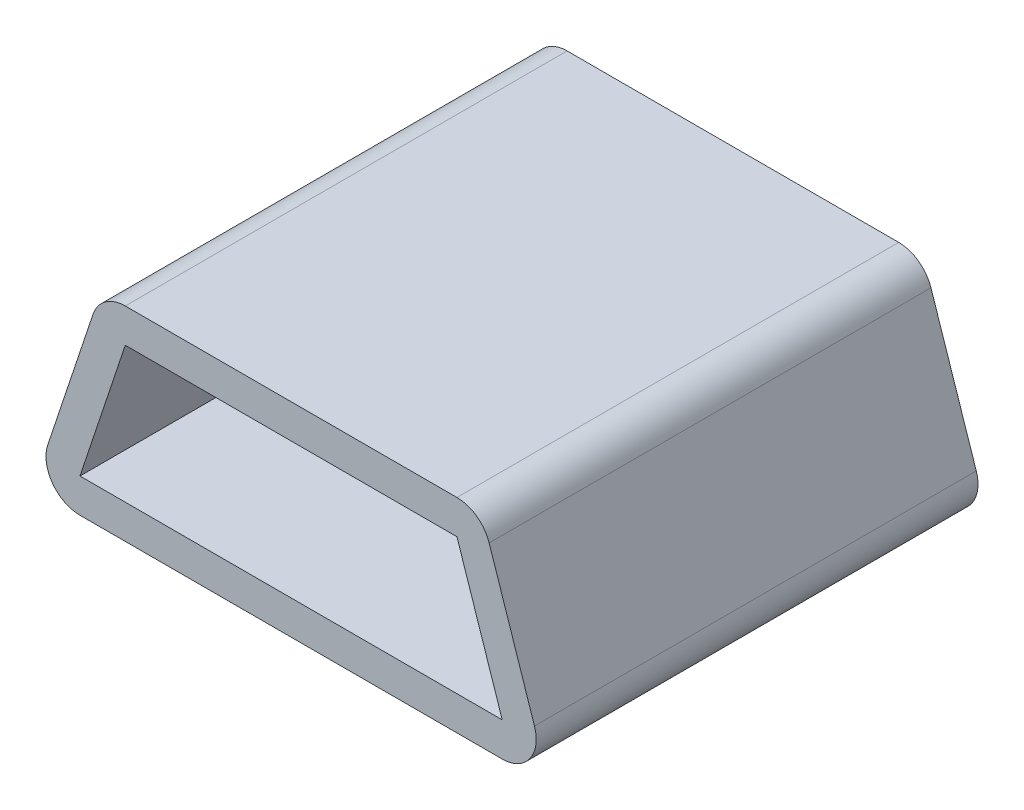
ISO-10303-21;
HEADER;
FILE_DESCRIPTION(('STEP AP214'),'2;1');
FILE_NAME('part.step','',(''),(''),'','','');
FILE_SCHEMA(('AUTOMOTIVE_DESIGN { 1 0 10303 214 1 1 1 1 }'));
ENDSEC;
DATA;
#1=APPLICATION_CONTEXT('core data for automotive mechanical design processes');
#2=APPLICATION_PROTOCOL_DEFINITION('international standard','automotive_design',2000,#1);
#3=PRODUCT_CONTEXT('',#1,'mechanical');
#4=PRODUCT('Part','Part','',(#3));
#5=PRODUCT_RELATED_PRODUCT_CATEGORY('part','',(#4));
#6=PRODUCT_DEFINITION_FORMATION('','',#4);
#7=PRODUCT_DEFINITION_CONTEXT('part definition',#1,'design');
#8=PRODUCT_DEFINITION('design','',#6,#7);
#9=PRODUCT_DEFINITION_SHAPE('','',#8);
#10=(LENGTH_UNIT() NAMED_UNIT(*) SI_UNIT(.MILLI.,.METRE.));
#11=(NAMED_UNIT(*) PLANE_ANGLE_UNIT() SI_UNIT($,.RADIAN.));
#12=(NAMED_UNIT(*) SI_UNIT($,.STERADIAN.) SOLID_ANGLE_UNIT());
#13=UNCERTAINTY_MEASURE_WITH_UNIT(LENGTH_MEASURE(1.E-05),#10,'distance_accuracy_value','');
#14=(GEOMETRIC_REPRESENTATION_CONTEXT(3) GLOBAL_UNCERTAINTY_ASSIGNED_CONTEXT((#13)) GLOBAL_UNIT_ASSIGNED_CONTEXT((#10,
#11,#12)) REPRESENTATION_CONTEXT('',''));
#15=CARTESIAN_POINT('',(0.,0.,0.));
#16=DIRECTION('',(0.,0.,1.));
#17=DIRECTION('',(1.,0.,0.));
#18=AXIS2_PLACEMENT_3D('',#15,#16,#17);
#19=CARTESIAN_POINT('',(2.8,3.,6.5));
#20=DIRECTION('',(-0.948683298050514,-0.316227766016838,0.));
#21=DIRECTION('',(0.316227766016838,-0.948683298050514,0.));
#22=AXIS2_PLACEMENT_3D('',#19,#20,#21);
#23=PLANE('',#22);
#24=DIRECTION('',(-0.316227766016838,0.948683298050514,0.));
#25=VECTOR('',#24,1.);
#26=CARTESIAN_POINT('',(2.8,3.,0.));
#27=LINE('',#26,#25);
#28=CARTESIAN_POINT('',(3.58062870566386,0.65811388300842,0.));
#29=VERTEX_POINT('',#28);
#30=CARTESIAN_POINT('',(2.91396203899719,2.65811388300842,0.));
#31=VERTEX_POINT('',#30);
#32=EDGE_CURVE('E174',#29,#31,#27,.T.);
#33=ORIENTED_EDGE('',*,*,#32,.T.);
#34=DIRECTION('',(0.,0.,-1.));
#35=VECTOR('',#34,1.);
#36=CARTESIAN_POINT('',(2.91396203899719,2.65811388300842,6.5));
#37=LINE('',#36,#35);
#38=CARTESIAN_POINT('',(2.91396203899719,2.65811388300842,6.5));
#39=VERTEX_POINT('',#38);
#40=EDGE_CURVE('E211',#31,#39,#37,.F.);
#41=ORIENTED_EDGE('',*,*,#40,.T.);
#42=DIRECTION('',(-0.316227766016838,0.948683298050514,0.));
#43=VECTOR('',#42,1.);
#44=CARTESIAN_POINT('',(2.8,3.,6.5));
#45=LINE('',#44,#43);
#46=CARTESIAN_POINT('',(3.58062870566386,0.65811388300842,6.5));
#47=VERTEX_POINT('',#46);
#48=EDGE_CURVE('E162',#47,#39,#45,.T.);
#49=ORIENTED_EDGE('',*,*,#48,.F.);
#50=DIRECTION('',(0.,0.,-1.));
#51=VECTOR('',#50,1.);
#52=CARTESIAN_POINT('',(3.58062870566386,0.65811388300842,6.5));
#53=LINE('',#52,#51);
#54=EDGE_CURVE('E208',#47,#29,#53,.T.);
#55=ORIENTED_EDGE('',*,*,#54,.T.);
#56=EDGE_LOOP('',(#33,#41,#49,#55));
#57=FACE_BOUND('',#56,.T.);
#58=ADVANCED_FACE('F36',(#57),#23,.F.);
#59=CARTESIAN_POINT('',(-2.8,3.,6.5));
#60=DIRECTION('',(0.,-1.,0.));
#61=DIRECTION('',(1.,0.,0.));
#62=AXIS2_PLACEMENT_3D('',#59,#60,#61);
#63=PLANE('',#62);
#64=DIRECTION('',(-1.,0.,0.));
#65=VECTOR('',#64,1.);
#66=CARTESIAN_POINT('',(-2.8,3.,0.));
#67=LINE('',#66,#65);
#68=CARTESIAN_POINT('',(2.43962038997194,3.,0.));
#69=VERTEX_POINT('',#68);
#70=CARTESIAN_POINT('',(-2.43962038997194,3.,0.));
#71=VERTEX_POINT('',#70);
#72=EDGE_CURVE('E177',#69,#71,#67,.T.);
#73=ORIENTED_EDGE('',*,*,#72,.T.);
#74=DIRECTION('',(0.,0.,-1.));
#75=VECTOR('',#74,1.);
#76=CARTESIAN_POINT('',(-2.43962038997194,3.,6.5));
#77=LINE('',#76,#75);
#78=CARTESIAN_POINT('',(-2.43962038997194,3.,6.5));
#79=VERTEX_POINT('',#78);
#80=EDGE_CURVE('E199',#71,#79,#77,.F.);
#81=ORIENTED_EDGE('',*,*,#80,.T.);
#82=DIRECTION('',(-1.,0.,0.));
#83=VECTOR('',#82,1.);
#84=CARTESIAN_POINT('',(-2.8,3.,6.5));
#85=LINE('',#84,#83);
#86=CARTESIAN_POINT('',(2.43962038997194,3.,6.5));
#87=VERTEX_POINT('',#86);
#88=EDGE_CURVE('E165',#87,#79,#85,.T.);
#89=ORIENTED_EDGE('',*,*,#88,.F.);
#90=DIRECTION('',(0.,0.,-1.));
#91=VECTOR('',#90,1.);
#92=CARTESIAN_POINT('',(2.43962038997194,3.,6.5));
#93=LINE('',#92,#91);
#94=EDGE_CURVE('E196',#87,#69,#93,.T.);
#95=ORIENTED_EDGE('',*,*,#94,.T.);
#96=EDGE_LOOP('',(#73,#81,#89,#95));
#97=FACE_BOUND('',#96,.T.);
#98=ADVANCED_FACE('F236',(#97),#63,.F.);
#99=CARTESIAN_POINT('',(-2.8,3.,6.5));
#100=DIRECTION('',(0.948683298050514,-0.316227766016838,0.));
#101=DIRECTION('',(0.316227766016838,0.948683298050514,0.));
#102=AXIS2_PLACEMENT_3D('',#99,#100,#101);
#103=PLANE('',#102);
#104=DIRECTION('',(-0.316227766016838,-0.948683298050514,0.));
#105=VECTOR('',#104,1.);
#106=CARTESIAN_POINT('',(-2.8,3.,6.5));
#107=LINE('',#106,#105);
#108=CARTESIAN_POINT('',(-2.91396203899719,2.65811388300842,6.5));
#109=VERTEX_POINT('',#108);
#110=CARTESIAN_POINT('',(-3.58062870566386,0.658113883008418,6.5));
#111=VERTEX_POINT('',#110);
#112=EDGE_CURVE('E169',#109,#111,#107,.T.);
#113=ORIENTED_EDGE('',*,*,#112,.F.);
#114=DIRECTION('',(0.,0.,-1.));
#115=VECTOR('',#114,1.);
#116=CARTESIAN_POINT('',(-2.91396203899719,2.65811388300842,6.5));
#117=LINE('',#116,#115);
#118=CARTESIAN_POINT('',(-2.91396203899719,2.65811388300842,0.));
#119=VERTEX_POINT('',#118);
#120=EDGE_CURVE('E185',#109,#119,#117,.T.);
#121=ORIENTED_EDGE('',*,*,#120,.T.);
#122=DIRECTION('',(-0.316227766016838,-0.948683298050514,0.));
#123=VECTOR('',#122,1.);
#124=CARTESIAN_POINT('',(-2.8,3.,0.));
#125=LINE('',#124,#123);
#126=CARTESIAN_POINT('',(-3.58062870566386,0.658113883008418,0.));
#127=VERTEX_POINT('',#126);
#128=EDGE_CURVE('E180',#119,#127,#125,.T.);
#129=ORIENTED_EDGE('',*,*,#128,.T.);
#130=DIRECTION('',(0.,0.,-1.));
#131=VECTOR('',#130,1.);
#132=CARTESIAN_POINT('',(-3.58062870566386,0.658113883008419,6.5));
#133=LINE('',#132,#131);
#134=EDGE_CURVE('E173',#127,#111,#133,.F.);
#135=ORIENTED_EDGE('',*,*,#134,.T.);
#136=EDGE_LOOP('',(#113,#121,#129,#135));
#137=FACE_BOUND('',#136,.T.);
#138=ADVANCED_FACE('F244',(#137),#103,.F.);
#139=CARTESIAN_POINT('',(-3.8,0.,6.5));
#140=DIRECTION('',(0.,1.,0.));
#141=DIRECTION('',(-1.,0.,0.));
#142=AXIS2_PLACEMENT_3D('',#139,#140,#141);
#143=PLANE('',#142);
#144=DIRECTION('',(1.,0.,0.));
#145=VECTOR('',#144,1.);
#146=CARTESIAN_POINT('',(-3.8,0.,0.));
#147=LINE('',#146,#145);
#148=CARTESIAN_POINT('',(-3.1062870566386,0.,0.));
#149=VERTEX_POINT('',#148);
#150=CARTESIAN_POINT('',(3.1062870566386,0.,0.));
#151=VERTEX_POINT('',#150);
#152=EDGE_CURVE('E166',#149,#151,#147,.T.);
#153=ORIENTED_EDGE('',*,*,#152,.T.);
#154=DIRECTION('',(0.,0.,-1.));
#155=VECTOR('',#154,1.);
#156=CARTESIAN_POINT('',(3.1062870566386,0.,6.5));
#157=LINE('',#156,#155);
#158=CARTESIAN_POINT('',(3.1062870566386,0.,6.5));
#159=VERTEX_POINT('',#158);
#160=EDGE_CURVE('E11',#151,#159,#157,.F.);
#161=ORIENTED_EDGE('',*,*,#160,.T.);
#162=DIRECTION('',(1.,0.,0.));
#163=VECTOR('',#162,1.);
#164=CARTESIAN_POINT('',(-3.8,0.,6.5));
#165=LINE('',#164,#163);
#166=CARTESIAN_POINT('',(-3.1062870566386,0.,6.5));
#167=VERTEX_POINT('',#166);
#168=EDGE_CURVE('E171',#167,#159,#165,.T.);
#169=ORIENTED_EDGE('',*,*,#168,.F.);
#170=DIRECTION('',(0.,0.,-1.));
#171=VECTOR('',#170,1.);
#172=CARTESIAN_POINT('',(-3.1062870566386,0.,6.5));
#173=LINE('',#172,#171);
#174=EDGE_CURVE('E44',#167,#149,#173,.T.);
#175=ORIENTED_EDGE('',*,*,#174,.T.);
#176=EDGE_LOOP('',(#153,#161,#169,#175));
#177=FACE_BOUND('',#176,.T.);
#178=ADVANCED_FACE('F215',(#177),#143,.F.);
#179=CARTESIAN_POINT('',(0.,0.,6.5));
#180=DIRECTION('',(0.,0.,1.));
#181=DIRECTION('',(1.,0.,0.));
#182=AXIS2_PLACEMENT_3D('',#179,#180,#181);
#183=PLANE('',#182);
#184=DIRECTION('',(-0.316227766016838,0.948683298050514,0.));
#185=VECTOR('',#184,1.);
#186=CARTESIAN_POINT('',(2.32565835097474,2.84188611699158,6.5));
#187=LINE('',#186,#185);
#188=CARTESIAN_POINT('',(3.1062870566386,0.500000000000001,6.5));
#189=VERTEX_POINT('',#188);
#190=CARTESIAN_POINT('',(2.43962038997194,2.5,6.5));
#191=VERTEX_POINT('',#190);
#192=EDGE_CURVE('E151',#189,#191,#187,.T.);
#193=ORIENTED_EDGE('',*,*,#192,.F.);
#194=DIRECTION('',(1.,0.,0.));
#195=VECTOR('',#194,1.);
#196=CARTESIAN_POINT('',(-3.8,0.5,6.5));
#197=LINE('',#196,#195);
#198=CARTESIAN_POINT('',(-3.1062870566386,0.5,6.5));
#199=VERTEX_POINT('',#198);
#200=EDGE_CURVE('E160',#199,#189,#197,.T.);
#201=ORIENTED_EDGE('',*,*,#200,.F.);
#202=DIRECTION('',(-0.316227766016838,-0.948683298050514,0.));
#203=VECTOR('',#202,1.);
#204=CARTESIAN_POINT('',(-2.32565835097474,2.84188611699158,6.5));
#205=LINE('',#204,#203);
#206=CARTESIAN_POINT('',(-2.43962038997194,2.5,6.5));
#207=VERTEX_POINT('',#206);
#208=EDGE_CURVE('E158',#207,#199,#205,.T.);
#209=ORIENTED_EDGE('',*,*,#208,.F.);
#210=DIRECTION('',(-1.,0.,0.));
#211=VECTOR('',#210,1.);
#212=CARTESIAN_POINT('',(-2.8,2.5,6.5));
#213=LINE('',#212,#211);
#214=EDGE_CURVE('E140',#191,#207,#213,.T.);
#215=ORIENTED_EDGE('',*,*,#214,.F.);
#216=EDGE_LOOP('',(#193,#201,#209,#215));
#217=FACE_BOUND('',#216,.T.);
#218=ORIENTED_EDGE('',*,*,#88,.T.);
#219=CARTESIAN_POINT('',(-2.43962038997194,2.5,6.5));
#220=DIRECTION('',(0.,0.,1.));
#221=DIRECTION('',(1.,0.,0.));
#222=AXIS2_PLACEMENT_3D('',#219,#220,#221);
#223=CIRCLE('',#222,0.5);
#224=EDGE_CURVE('E206',#79,#109,#223,.T.);
#225=ORIENTED_EDGE('',*,*,#224,.T.);
#226=ORIENTED_EDGE('',*,*,#112,.T.);
#227=CARTESIAN_POINT('',(-3.1062870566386,0.5,6.5));
#228=DIRECTION('',(0.,0.,1.));
#229=DIRECTION('',(1.,0.,0.));
#230=AXIS2_PLACEMENT_3D('',#227,#228,#229);
#231=CIRCLE('',#230,0.5);
#232=EDGE_CURVE('E56',#111,#167,#231,.T.);
#233=ORIENTED_EDGE('',*,*,#232,.T.);
#234=ORIENTED_EDGE('',*,*,#168,.T.);
#235=CARTESIAN_POINT('',(3.1062870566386,0.500000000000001,6.5));
#236=DIRECTION('',(0.,0.,1.));
#237=DIRECTION('',(1.,0.,0.));
#238=AXIS2_PLACEMENT_3D('',#235,#236,#237);
#239=CIRCLE('',#238,0.5);
#240=EDGE_CURVE('E202',#159,#47,#239,.T.);
#241=ORIENTED_EDGE('',*,*,#240,.T.);
#242=ORIENTED_EDGE('',*,*,#48,.T.);
#243=CARTESIAN_POINT('',(2.43962038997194,2.5,6.5));
#244=DIRECTION('',(0.,0.,1.));
#245=DIRECTION('',(1.,0.,0.));
#246=AXIS2_PLACEMENT_3D('',#243,#244,#245);
#247=CIRCLE('',#246,0.5);
#248=EDGE_CURVE('E204',#39,#87,#247,.T.);
#249=ORIENTED_EDGE('',*,*,#248,.T.);
#250=EDGE_LOOP('',(#218,#225,#226,#233,#234,#241,#242,#249));
#251=FACE_BOUND('',#250,.T.);
#252=ADVANCED_FACE('F229',(#217,#251),#183,.T.);
#253=CARTESIAN_POINT('',(0.,0.,0.));
#254=DIRECTION('',(0.,0.,1.));
#255=DIRECTION('',(1.,0.,0.));
#256=AXIS2_PLACEMENT_3D('',#253,#254,#255);
#257=PLANE('',#256);
#258=ORIENTED_EDGE('',*,*,#128,.F.);
#259=CARTESIAN_POINT('',(-2.43962038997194,2.5,0.));
#260=DIRECTION('',(0.,0.,1.));
#261=DIRECTION('',(1.,0.,0.));
#262=AXIS2_PLACEMENT_3D('',#259,#260,#261);
#263=CIRCLE('',#262,0.5);
#264=EDGE_CURVE('E194',#119,#71,#263,.F.);
#265=ORIENTED_EDGE('',*,*,#264,.T.);
#266=ORIENTED_EDGE('',*,*,#72,.F.);
#267=CARTESIAN_POINT('',(2.43962038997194,2.5,0.));
#268=DIRECTION('',(0.,0.,1.));
#269=DIRECTION('',(1.,0.,0.));
#270=AXIS2_PLACEMENT_3D('',#267,#268,#269);
#271=CIRCLE('',#270,0.5);
#272=EDGE_CURVE('E192',#69,#31,#271,.F.);
#273=ORIENTED_EDGE('',*,*,#272,.T.);
#274=ORIENTED_EDGE('',*,*,#32,.F.);
#275=CARTESIAN_POINT('',(3.1062870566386,0.500000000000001,0.));
#276=DIRECTION('',(0.,0.,1.));
#277=DIRECTION('',(1.,0.,0.));
#278=AXIS2_PLACEMENT_3D('',#275,#276,#277);
#279=CIRCLE('',#278,0.5);
#280=EDGE_CURVE('E190',#29,#151,#279,.F.);
#281=ORIENTED_EDGE('',*,*,#280,.T.);
#282=ORIENTED_EDGE('',*,*,#152,.F.);
#283=CARTESIAN_POINT('',(-3.1062870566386,0.5,0.));
#284=DIRECTION('',(0.,0.,1.));
#285=DIRECTION('',(1.,0.,0.));
#286=AXIS2_PLACEMENT_3D('',#283,#284,#285);
#287=CIRCLE('',#286,0.5);
#288=EDGE_CURVE('E188',#149,#127,#287,.F.);
#289=ORIENTED_EDGE('',*,*,#288,.T.);
#290=EDGE_LOOP('',(#258,#265,#266,#273,#274,#281,#282,#289));
#291=FACE_BOUND('',#290,.T.);
#292=ADVANCED_FACE('F219',(#291),#257,.F.);
#293=CARTESIAN_POINT('',(2.32565835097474,2.84188611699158,6.5));
#294=DIRECTION('',(-0.948683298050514,-0.316227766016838,0.));
#295=DIRECTION('',(0.316227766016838,-0.948683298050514,0.));
#296=AXIS2_PLACEMENT_3D('',#293,#294,#295);
#297=PLANE('',#296);
#298=DIRECTION('',(-0.316227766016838,0.948683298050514,0.));
#299=VECTOR('',#298,1.);
#300=CARTESIAN_POINT('',(2.32565835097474,2.84188611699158,0.5));
#301=LINE('',#300,#299);
#302=CARTESIAN_POINT('',(3.1062870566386,0.500000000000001,0.5));
#303=VERTEX_POINT('',#302);
#304=CARTESIAN_POINT('',(2.43962038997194,2.5,0.5));
#305=VERTEX_POINT('',#304);
#306=EDGE_CURVE('E131',#303,#305,#301,.T.);
#307=ORIENTED_EDGE('',*,*,#306,.F.);
#308=DIRECTION('',(0.,0.,-1.));
#309=VECTOR('',#308,1.);
#310=CARTESIAN_POINT('',(3.1062870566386,0.500000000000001,6.5));
#311=LINE('',#310,#309);
#312=EDGE_CURVE('E154',#189,#303,#311,.T.);
#313=ORIENTED_EDGE('',*,*,#312,.F.);
#314=ORIENTED_EDGE('',*,*,#192,.T.);
#315=DIRECTION('',(0.,0.,-1.));
#316=VECTOR('',#315,1.);
#317=CARTESIAN_POINT('',(2.43962038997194,2.5,6.5));
#318=LINE('',#317,#316);
#319=EDGE_CURVE('E144',#191,#305,#318,.T.);
#320=ORIENTED_EDGE('',*,*,#319,.T.);
#321=EDGE_LOOP('',(#307,#313,#314,#320));
#322=FACE_BOUND('',#321,.T.);
#323=ADVANCED_FACE('F313',(#322),#297,.T.);
#324=CARTESIAN_POINT('',(-2.8,2.5,6.5));
#325=DIRECTION('',(0.,-1.,0.));
#326=DIRECTION('',(1.,0.,0.));
#327=AXIS2_PLACEMENT_3D('',#324,#325,#326);
#328=PLANE('',#327);
#329=DIRECTION('',(-1.,0.,0.));
#330=VECTOR('',#329,1.);
#331=CARTESIAN_POINT('',(-2.8,2.5,0.5));
#332=LINE('',#331,#330);
#333=CARTESIAN_POINT('',(-2.43962038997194,2.5,0.5));
#334=VERTEX_POINT('',#333);
#335=EDGE_CURVE('E124',#305,#334,#332,.T.);
#336=ORIENTED_EDGE('',*,*,#335,.F.);
#337=ORIENTED_EDGE('',*,*,#319,.F.);
#338=ORIENTED_EDGE('',*,*,#214,.T.);
#339=DIRECTION('',(0.,0.,-1.));
#340=VECTOR('',#339,1.);
#341=CARTESIAN_POINT('',(-2.43962038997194,2.5,6.5));
#342=LINE('',#341,#340);
#343=EDGE_CURVE('E137',#207,#334,#342,.T.);
#344=ORIENTED_EDGE('',*,*,#343,.T.);
#345=EDGE_LOOP('',(#336,#337,#338,#344));
#346=FACE_BOUND('',#345,.T.);
#347=ADVANCED_FACE('F138',(#346),#328,.T.);
#348=CARTESIAN_POINT('',(-2.32565835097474,2.84188611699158,6.5));
#349=DIRECTION('',(0.948683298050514,-0.316227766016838,0.));
#350=DIRECTION('',(0.316227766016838,0.948683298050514,0.));
#351=AXIS2_PLACEMENT_3D('',#348,#349,#350);
#352=PLANE('',#351);
#353=DIRECTION('',(-0.316227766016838,-0.948683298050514,0.));
#354=VECTOR('',#353,1.);
#355=CARTESIAN_POINT('',(-2.32565835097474,2.84188611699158,0.5));
#356=LINE('',#355,#354);
#357=CARTESIAN_POINT('',(-3.1062870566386,0.5,0.5));
#358=VERTEX_POINT('',#357);
#359=EDGE_CURVE('E128',#334,#358,#356,.T.);
#360=ORIENTED_EDGE('',*,*,#359,.F.);
#361=ORIENTED_EDGE('',*,*,#343,.F.);
#362=ORIENTED_EDGE('',*,*,#208,.T.);
#363=DIRECTION('',(0.,0.,-1.));
#364=VECTOR('',#363,1.);
#365=CARTESIAN_POINT('',(-3.1062870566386,0.5,6.5));
#366=LINE('',#365,#364);
#367=EDGE_CURVE('E145',#199,#358,#366,.T.);
#368=ORIENTED_EDGE('',*,*,#367,.T.);
#369=EDGE_LOOP('',(#360,#361,#362,#368));
#370=FACE_BOUND('',#369,.T.);
#371=ADVANCED_FACE('F147',(#370),#352,.T.);
#372=CARTESIAN_POINT('',(-3.8,0.5,6.5));
#373=DIRECTION('',(0.,1.,0.));
#374=DIRECTION('',(-1.,0.,0.));
#375=AXIS2_PLACEMENT_3D('',#372,#373,#374);
#376=PLANE('',#375);
#377=DIRECTION('',(1.,0.,0.));
#378=VECTOR('',#377,1.);
#379=CARTESIAN_POINT('',(-3.8,0.5,0.5));
#380=LINE('',#379,#378);
#381=EDGE_CURVE('E149',#358,#303,#380,.T.);
#382=ORIENTED_EDGE('',*,*,#381,.F.);
#383=ORIENTED_EDGE('',*,*,#367,.F.);
#384=ORIENTED_EDGE('',*,*,#200,.T.);
#385=ORIENTED_EDGE('',*,*,#312,.T.);
#386=EDGE_LOOP('',(#382,#383,#384,#385));
#387=FACE_BOUND('',#386,.T.);
#388=ADVANCED_FACE('F290',(#387),#376,.T.);
#389=CARTESIAN_POINT('',(0.,0.,0.5));
#390=DIRECTION('',(0.,0.,1.));
#391=DIRECTION('',(1.,0.,0.));
#392=AXIS2_PLACEMENT_3D('',#389,#390,#391);
#393=PLANE('',#392);
#394=ORIENTED_EDGE('',*,*,#306,.T.);
#395=ORIENTED_EDGE('',*,*,#335,.T.);
#396=ORIENTED_EDGE('',*,*,#359,.T.);
#397=ORIENTED_EDGE('',*,*,#381,.T.);
#398=EDGE_LOOP('',(#394,#395,#396,#397));
#399=FACE_BOUND('',#398,.T.);
#400=ADVANCED_FACE('F126',(#399),#393,.T.);
#401=CARTESIAN_POINT('',(-2.43962038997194,2.5,6.5));
#402=DIRECTION('',(0.,0.,-1.));
#403=DIRECTION('',(-1.,0.,0.));
#404=AXIS2_PLACEMENT_3D('',#401,#402,#403);
#405=CYLINDRICAL_SURFACE('',#404,0.5);
#406=ORIENTED_EDGE('',*,*,#224,.F.);
#407=ORIENTED_EDGE('',*,*,#80,.F.);
#408=ORIENTED_EDGE('',*,*,#264,.F.);
#409=ORIENTED_EDGE('',*,*,#120,.F.);
#410=EDGE_LOOP('',(#406,#407,#408,#409));
#411=FACE_BOUND('',#410,.T.);
#412=ADVANCED_FACE('F241',(#411),#405,.T.);
#413=CARTESIAN_POINT('',(2.43962038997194,2.5,6.5));
#414=DIRECTION('',(0.,0.,-1.));
#415=DIRECTION('',(-1.,0.,0.));
#416=AXIS2_PLACEMENT_3D('',#413,#414,#415);
#417=CYLINDRICAL_SURFACE('',#416,0.5);
#418=ORIENTED_EDGE('',*,*,#248,.F.);
#419=ORIENTED_EDGE('',*,*,#40,.F.);
#420=ORIENTED_EDGE('',*,*,#272,.F.);
#421=ORIENTED_EDGE('',*,*,#94,.F.);
#422=EDGE_LOOP('',(#418,#419,#420,#421));
#423=FACE_BOUND('',#422,.T.);
#424=ADVANCED_FACE('F233',(#423),#417,.T.);
#425=CARTESIAN_POINT('',(3.1062870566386,0.500000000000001,6.5));
#426=DIRECTION('',(0.,0.,-1.));
#427=DIRECTION('',(-1.,0.,0.));
#428=AXIS2_PLACEMENT_3D('',#425,#426,#427);
#429=CYLINDRICAL_SURFACE('',#428,0.5);
#430=ORIENTED_EDGE('',*,*,#240,.F.);
#431=ORIENTED_EDGE('',*,*,#160,.F.);
#432=ORIENTED_EDGE('',*,*,#280,.F.);
#433=ORIENTED_EDGE('',*,*,#54,.F.);
#434=EDGE_LOOP('',(#430,#431,#432,#433));
#435=FACE_BOUND('',#434,.T.);
#436=ADVANCED_FACE('F224',(#435),#429,.T.);
#437=CARTESIAN_POINT('',(-3.1062870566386,0.5,6.5));
#438=DIRECTION('',(0.,0.,-1.));
#439=DIRECTION('',(-1.,0.,0.));
#440=AXIS2_PLACEMENT_3D('',#437,#438,#439);
#441=CYLINDRICAL_SURFACE('',#440,0.5);
#442=ORIENTED_EDGE('',*,*,#232,.F.);
#443=ORIENTED_EDGE('',*,*,#134,.F.);
#444=ORIENTED_EDGE('',*,*,#288,.F.);
#445=ORIENTED_EDGE('',*,*,#174,.F.);
#446=EDGE_LOOP('',(#442,#443,#444,#445));
#447=FACE_BOUND('',#446,.T.);
#448=ADVANCED_FACE('F38',(#447),#441,.T.);
#449=CLOSED_SHELL('',(#58,#98,#138,#178,#252,#292,#323,#347,#371,#388,#400,#412,#424,#436,#448));
#450=MANIFOLD_SOLID_BREP('B2',#449);
#451=ADVANCED_BREP_SHAPE_REPRESENTATION('',(#18,#450),#14);
#452=SHAPE_DEFINITION_REPRESENTATION(#9,#451);
ENDSEC;
END-ISO-10303-21;
